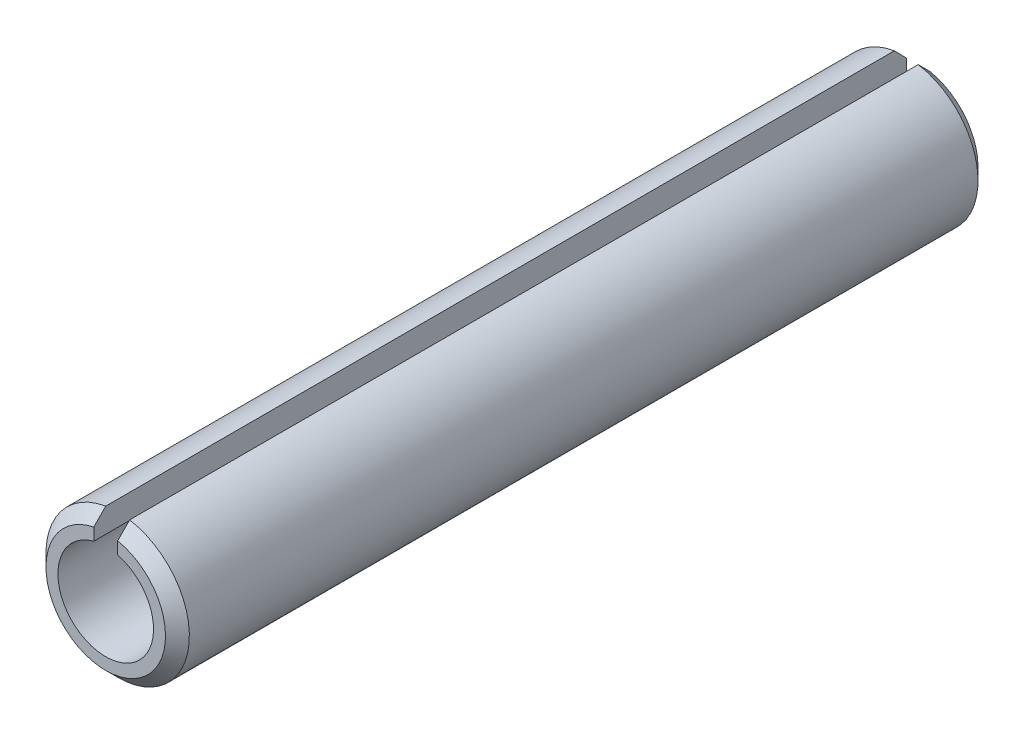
ISO-10303-21;
HEADER;
FILE_DESCRIPTION(('STEP AP214'),'2;1');
FILE_NAME('part.step','',(''),(''),'','','');
FILE_SCHEMA(('AUTOMOTIVE_DESIGN { 1 0 10303 214 1 1 1 1 }'));
ENDSEC;
DATA;
#1=APPLICATION_CONTEXT('core data for automotive mechanical design processes');
#2=APPLICATION_PROTOCOL_DEFINITION('international standard','automotive_design',2000,#1);
#3=PRODUCT_CONTEXT('',#1,'mechanical');
#4=PRODUCT('Part','Part','',(#3));
#5=PRODUCT_RELATED_PRODUCT_CATEGORY('part','',(#4));
#6=PRODUCT_DEFINITION_FORMATION('','',#4);
#7=PRODUCT_DEFINITION_CONTEXT('part definition',#1,'design');
#8=PRODUCT_DEFINITION('design','',#6,#7);
#9=PRODUCT_DEFINITION_SHAPE('','',#8);
#10=(LENGTH_UNIT() NAMED_UNIT(*) SI_UNIT(.MILLI.,.METRE.));
#11=(NAMED_UNIT(*) PLANE_ANGLE_UNIT() SI_UNIT($,.RADIAN.));
#12=(NAMED_UNIT(*) SI_UNIT($,.STERADIAN.) SOLID_ANGLE_UNIT());
#13=UNCERTAINTY_MEASURE_WITH_UNIT(LENGTH_MEASURE(1.E-05),#10,'distance_accuracy_value','');
#14=(GEOMETRIC_REPRESENTATION_CONTEXT(3) GLOBAL_UNCERTAINTY_ASSIGNED_CONTEXT((#13)) GLOBAL_UNIT_ASSIGNED_CONTEXT((#10,
#11,#12)) REPRESENTATION_CONTEXT('',''));
#15=CARTESIAN_POINT('',(0.,0.,0.));
#16=DIRECTION('',(0.,0.,1.));
#17=DIRECTION('',(1.,0.,0.));
#18=AXIS2_PLACEMENT_3D('',#15,#16,#17);
#19=CARTESIAN_POINT('',(0.,0.,17.));
#20=DIRECTION('',(0.,0.,-1.));
#21=DIRECTION('',(-1.,0.,0.));
#22=AXIS2_PLACEMENT_3D('',#19,#20,#21);
#23=CYLINDRICAL_SURFACE('',#22,1.5);
#24=DIRECTION('',(0.,0.,-1.));
#25=VECTOR('',#24,1.);
#26=CARTESIAN_POINT('',(0.249999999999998,1.4790199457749,17.));
#27=LINE('',#26,#25);
#28=CARTESIAN_POINT('',(0.249999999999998,1.4790199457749,16.75));
#29=VERTEX_POINT('',#28);
#30=CARTESIAN_POINT('',(0.249999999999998,1.4790199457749,0.250000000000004));
#31=VERTEX_POINT('',#30);
#32=EDGE_CURVE('E110',#29,#31,#27,.T.);
#33=ORIENTED_EDGE('',*,*,#32,.F.);
#34=CARTESIAN_POINT('',(0.,0.,16.75));
#35=DIRECTION('',(0.,0.,1.));
#36=DIRECTION('',(1.,0.,0.));
#37=AXIS2_PLACEMENT_3D('',#34,#35,#36);
#38=CIRCLE('',#37,1.5);
#39=CARTESIAN_POINT('',(-0.250000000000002,1.4790199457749,16.75));
#40=VERTEX_POINT('',#39);
#41=EDGE_CURVE('E38',#29,#40,#38,.F.);
#42=ORIENTED_EDGE('',*,*,#41,.T.);
#43=DIRECTION('',(0.,0.,-1.));
#44=VECTOR('',#43,1.);
#45=CARTESIAN_POINT('',(-0.250000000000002,1.4790199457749,17.));
#46=LINE('',#45,#44);
#47=CARTESIAN_POINT('',(-0.250000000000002,1.4790199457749,0.250000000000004));
#48=VERTEX_POINT('',#47);
#49=EDGE_CURVE('E154',#40,#48,#46,.T.);
#50=ORIENTED_EDGE('',*,*,#49,.T.);
#51=CARTESIAN_POINT('',(0.,0.,0.250000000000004));
#52=DIRECTION('',(0.,0.,1.));
#53=DIRECTION('',(1.,0.,0.));
#54=AXIS2_PLACEMENT_3D('',#51,#52,#53);
#55=CIRCLE('',#54,1.5);
#56=EDGE_CURVE('E102',#48,#31,#55,.T.);
#57=ORIENTED_EDGE('',*,*,#56,.T.);
#58=EDGE_LOOP('',(#33,#42,#50,#57));
#59=FACE_BOUND('',#58,.T.);
#60=ADVANCED_FACE('F26',(#59),#23,.T.);
#61=CARTESIAN_POINT('',(0.,0.,17.));
#62=DIRECTION('',(0.,0.,1.));
#63=DIRECTION('',(1.,0.,0.));
#64=AXIS2_PLACEMENT_3D('',#61,#62,#63);
#65=PLANE('',#64);
#66=DIRECTION('',(0.,-1.,0.));
#67=VECTOR('',#66,1.);
#68=CARTESIAN_POINT('',(-0.250000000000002,0.,17.));
#69=LINE('',#68,#67);
#70=CARTESIAN_POINT('',(-0.250000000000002,1.22474487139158,17.));
#71=VERTEX_POINT('',#70);
#72=CARTESIAN_POINT('',(-0.250000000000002,0.968245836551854,17.));
#73=VERTEX_POINT('',#72);
#74=EDGE_CURVE('E93',#71,#73,#69,.T.);
#75=ORIENTED_EDGE('',*,*,#74,.F.);
#76=CARTESIAN_POINT('',(0.,0.,17.));
#77=DIRECTION('',(0.,0.,1.));
#78=DIRECTION('',(1.,0.,0.));
#79=AXIS2_PLACEMENT_3D('',#76,#77,#78);
#80=CIRCLE('',#79,1.25);
#81=CARTESIAN_POINT('',(0.249999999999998,1.22474487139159,17.));
#82=VERTEX_POINT('',#81);
#83=EDGE_CURVE('E140',#71,#82,#80,.T.);
#84=ORIENTED_EDGE('',*,*,#83,.T.);
#85=DIRECTION('',(0.,-1.,0.));
#86=VECTOR('',#85,1.);
#87=CARTESIAN_POINT('',(0.249999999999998,0.,17.));
#88=LINE('',#87,#86);
#89=CARTESIAN_POINT('',(0.249999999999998,0.968245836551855,17.));
#90=VERTEX_POINT('',#89);
#91=EDGE_CURVE('E149',#82,#90,#88,.T.);
#92=ORIENTED_EDGE('',*,*,#91,.T.);
#93=CARTESIAN_POINT('',(0.,0.,17.));
#94=DIRECTION('',(0.,0.,1.));
#95=DIRECTION('',(1.,0.,0.));
#96=AXIS2_PLACEMENT_3D('',#93,#94,#95);
#97=CIRCLE('',#96,1.);
#98=EDGE_CURVE('E107',#73,#90,#97,.T.);
#99=ORIENTED_EDGE('',*,*,#98,.F.);
#100=EDGE_LOOP('',(#75,#84,#92,#99));
#101=FACE_BOUND('',#100,.T.);
#102=ADVANCED_FACE('F148',(#101),#65,.T.);
#103=CARTESIAN_POINT('',(0.,0.,0.));
#104=DIRECTION('',(0.,0.,1.));
#105=DIRECTION('',(1.,0.,0.));
#106=AXIS2_PLACEMENT_3D('',#103,#104,#105);
#107=PLANE('',#106);
#108=DIRECTION('',(0.,-1.,0.));
#109=VECTOR('',#108,1.);
#110=CARTESIAN_POINT('',(0.249999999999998,1.5,0.));
#111=LINE('',#110,#109);
#112=CARTESIAN_POINT('',(0.249999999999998,1.22474487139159,0.));
#113=VERTEX_POINT('',#112);
#114=CARTESIAN_POINT('',(0.249999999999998,0.968245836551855,0.));
#115=VERTEX_POINT('',#114);
#116=EDGE_CURVE('E152',#113,#115,#111,.T.);
#117=ORIENTED_EDGE('',*,*,#116,.F.);
#118=CARTESIAN_POINT('',(0.,0.,0.));
#119=DIRECTION('',(0.,0.,1.));
#120=DIRECTION('',(1.,0.,0.));
#121=AXIS2_PLACEMENT_3D('',#118,#119,#120);
#122=CIRCLE('',#121,1.25);
#123=CARTESIAN_POINT('',(-0.250000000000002,1.22474487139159,0.));
#124=VERTEX_POINT('',#123);
#125=EDGE_CURVE('E89',#113,#124,#122,.F.);
#126=ORIENTED_EDGE('',*,*,#125,.T.);
#127=DIRECTION('',(0.,-1.,0.));
#128=VECTOR('',#127,1.);
#129=CARTESIAN_POINT('',(-0.250000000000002,1.5,0.));
#130=LINE('',#129,#128);
#131=CARTESIAN_POINT('',(-0.250000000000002,0.968245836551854,0.));
#132=VERTEX_POINT('',#131);
#133=EDGE_CURVE('E81',#124,#132,#130,.T.);
#134=ORIENTED_EDGE('',*,*,#133,.T.);
#135=CARTESIAN_POINT('',(0.,0.,0.));
#136=DIRECTION('',(0.,0.,1.));
#137=DIRECTION('',(1.,0.,0.));
#138=AXIS2_PLACEMENT_3D('',#135,#136,#137);
#139=CIRCLE('',#138,1.);
#140=EDGE_CURVE('E86',#132,#115,#139,.T.);
#141=ORIENTED_EDGE('',*,*,#140,.T.);
#142=EDGE_LOOP('',(#117,#126,#134,#141));
#143=FACE_BOUND('',#142,.T.);
#144=ADVANCED_FACE('F84',(#143),#107,.F.);
#145=CARTESIAN_POINT('',(0.,0.,0.));
#146=DIRECTION('',(0.,0.,1.));
#147=DIRECTION('',(1.,0.,0.));
#148=AXIS2_PLACEMENT_3D('',#145,#146,#147);
#149=CYLINDRICAL_SURFACE('',#148,1.);
#150=ORIENTED_EDGE('',*,*,#140,.F.);
#151=DIRECTION('',(0.,0.,1.));
#152=VECTOR('',#151,1.);
#153=CARTESIAN_POINT('',(-0.250000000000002,0.968245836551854,0.));
#154=LINE('',#153,#152);
#155=EDGE_CURVE('E96',#132,#73,#154,.T.);
#156=ORIENTED_EDGE('',*,*,#155,.T.);
#157=ORIENTED_EDGE('',*,*,#98,.T.);
#158=DIRECTION('',(0.,0.,1.));
#159=VECTOR('',#158,1.);
#160=CARTESIAN_POINT('',(0.249999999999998,0.968245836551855,0.));
#161=LINE('',#160,#159);
#162=EDGE_CURVE('E103',#115,#90,#161,.T.);
#163=ORIENTED_EDGE('',*,*,#162,.F.);
#164=EDGE_LOOP('',(#150,#156,#157,#163));
#165=FACE_BOUND('',#164,.T.);
#166=ADVANCED_FACE('F105',(#165),#149,.F.);
#167=CARTESIAN_POINT('',(0.249999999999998,1.5,20.));
#168=DIRECTION('',(-1.,0.,0.));
#169=DIRECTION('',(0.,0.,1.));
#170=AXIS2_PLACEMENT_3D('',#167,#168,#169);
#171=PLANE('',#170);
#172=ORIENTED_EDGE('',*,*,#91,.F.);
#173=CARTESIAN_POINT('',(0.249999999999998,1.22474487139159,17.));
#174=CARTESIAN_POINT('',(0.249999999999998,1.26718937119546,16.9583997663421));
#175=CARTESIAN_POINT('',(0.249999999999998,1.30960121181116,16.9167663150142));
#176=CARTESIAN_POINT('',(0.249999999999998,1.39435956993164,16.8334329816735));
#177=CARTESIAN_POINT('',(0.249999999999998,1.4367060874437,16.791733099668));
#178=CARTESIAN_POINT('',(0.249999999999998,1.4790199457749,16.75));
#179=B_SPLINE_CURVE_WITH_KNOTS('',3,(#173,#174,#175,#176,#177,#178),.UNSPECIFIED.,.F.,.F.,(4,2,
4),(0.,0.178294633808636,0.356589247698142),.UNSPECIFIED.);
#180=EDGE_CURVE('E52',#82,#29,#179,.T.);
#181=ORIENTED_EDGE('',*,*,#180,.T.);
#182=ORIENTED_EDGE('',*,*,#32,.T.);
#183=CARTESIAN_POINT('',(0.249999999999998,1.4790199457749,0.250000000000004));
#184=CARTESIAN_POINT('',(0.249999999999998,1.4367060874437,0.208266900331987));
#185=CARTESIAN_POINT('',(0.249999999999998,1.39435956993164,0.166567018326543));
#186=CARTESIAN_POINT('',(0.249999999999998,1.30960121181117,0.0832336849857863));
#187=CARTESIAN_POINT('',(0.249999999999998,1.26718937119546,0.041600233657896));
#188=CARTESIAN_POINT('',(0.249999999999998,1.22474487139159,0.));
#189=B_SPLINE_CURVE_WITH_KNOTS('',3,(#183,#184,#185,#186,#187,#188),.UNSPECIFIED.,.F.,.F.,(4,2,
4),(0.,0.178294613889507,0.356589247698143),.UNSPECIFIED.);
#190=EDGE_CURVE('E116',#31,#113,#189,.T.);
#191=ORIENTED_EDGE('',*,*,#190,.T.);
#192=ORIENTED_EDGE('',*,*,#116,.T.);
#193=ORIENTED_EDGE('',*,*,#162,.T.);
#194=EDGE_LOOP('',(#172,#181,#182,#191,#192,#193));
#195=FACE_BOUND('',#194,.T.);
#196=ADVANCED_FACE('F124',(#195),#171,.T.);
#197=CARTESIAN_POINT('',(-0.250000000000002,1.5,20.));
#198=DIRECTION('',(-1.,0.,0.));
#199=DIRECTION('',(0.,0.,1.));
#200=AXIS2_PLACEMENT_3D('',#197,#198,#199);
#201=PLANE('',#200);
#202=ORIENTED_EDGE('',*,*,#49,.F.);
#203=CARTESIAN_POINT('',(-0.250000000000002,1.4790199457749,16.75));
#204=CARTESIAN_POINT('',(-0.250000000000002,1.4367060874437,16.791733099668));
#205=CARTESIAN_POINT('',(-0.250000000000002,1.39435956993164,16.8334329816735));
#206=CARTESIAN_POINT('',(-0.250000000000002,1.30960121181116,16.9167663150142));
#207=CARTESIAN_POINT('',(-0.250000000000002,1.26718937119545,16.9583997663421));
#208=CARTESIAN_POINT('',(-0.250000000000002,1.22474487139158,17.));
#209=B_SPLINE_CURVE_WITH_KNOTS('',3,(#203,#204,#205,#206,#207,#208),.UNSPECIFIED.,.F.,.F.,(4,2,
4),(0.,0.178294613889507,0.356589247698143),.UNSPECIFIED.);
#210=EDGE_CURVE('E11',#40,#71,#209,.T.);
#211=ORIENTED_EDGE('',*,*,#210,.T.);
#212=ORIENTED_EDGE('',*,*,#74,.T.);
#213=ORIENTED_EDGE('',*,*,#155,.F.);
#214=ORIENTED_EDGE('',*,*,#133,.F.);
#215=CARTESIAN_POINT('',(-0.250000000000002,1.22474487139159,0.));
#216=CARTESIAN_POINT('',(-0.250000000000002,1.26718937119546,0.0416002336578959));
#217=CARTESIAN_POINT('',(-0.250000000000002,1.30960121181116,0.0832336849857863));
#218=CARTESIAN_POINT('',(-0.250000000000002,1.39435956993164,0.166567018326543));
#219=CARTESIAN_POINT('',(-0.250000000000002,1.4367060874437,0.208266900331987));
#220=CARTESIAN_POINT('',(-0.250000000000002,1.4790199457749,0.250000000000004));
#221=B_SPLINE_CURVE_WITH_KNOTS('',3,(#215,#216,#217,#218,#219,#220),.UNSPECIFIED.,.F.,.F.,(4,2,
4),(0.,0.178294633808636,0.356589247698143),.UNSPECIFIED.);
#222=EDGE_CURVE('E135',#124,#48,#221,.T.);
#223=ORIENTED_EDGE('',*,*,#222,.T.);
#224=EDGE_LOOP('',(#202,#211,#212,#213,#214,#223));
#225=FACE_BOUND('',#224,.T.);
#226=ADVANCED_FACE('F97',(#225),#201,.F.);
#227=CARTESIAN_POINT('',(0.,0.,0.250000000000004));
#228=DIRECTION('',(0.,0.,1.));
#229=DIRECTION('',(1.,0.,0.));
#230=AXIS2_PLACEMENT_3D('',#227,#228,#229);
#231=CONICAL_SURFACE('',#230,1.5,0.785398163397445);
#232=ORIENTED_EDGE('',*,*,#222,.F.);
#233=ORIENTED_EDGE('',*,*,#125,.F.);
#234=ORIENTED_EDGE('',*,*,#190,.F.);
#235=ORIENTED_EDGE('',*,*,#56,.F.);
#236=EDGE_LOOP('',(#232,#233,#234,#235));
#237=FACE_BOUND('',#236,.T.);
#238=ADVANCED_FACE('F127',(#237),#231,.T.);
#239=CARTESIAN_POINT('',(0.,0.,17.));
#240=DIRECTION('',(0.,0.,-1.));
#241=DIRECTION('',(-1.,0.,0.));
#242=AXIS2_PLACEMENT_3D('',#239,#240,#241);
#243=CONICAL_SURFACE('',#242,1.25,0.785398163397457);
#244=ORIENTED_EDGE('',*,*,#210,.F.);
#245=ORIENTED_EDGE('',*,*,#41,.F.);
#246=ORIENTED_EDGE('',*,*,#180,.F.);
#247=ORIENTED_EDGE('',*,*,#83,.F.);
#248=EDGE_LOOP('',(#244,#245,#246,#247));
#249=FACE_BOUND('',#248,.T.);
#250=ADVANCED_FACE('F130',(#249),#243,.T.);
#251=CLOSED_SHELL('',(#60,#102,#144,#166,#196,#226,#238,#250));
#252=MANIFOLD_SOLID_BREP('B2',#251);
#253=ADVANCED_BREP_SHAPE_REPRESENTATION('',(#18,#252),#14);
#254=SHAPE_DEFINITION_REPRESENTATION(#9,#253);
ENDSEC;
END-ISO-10303-21;
